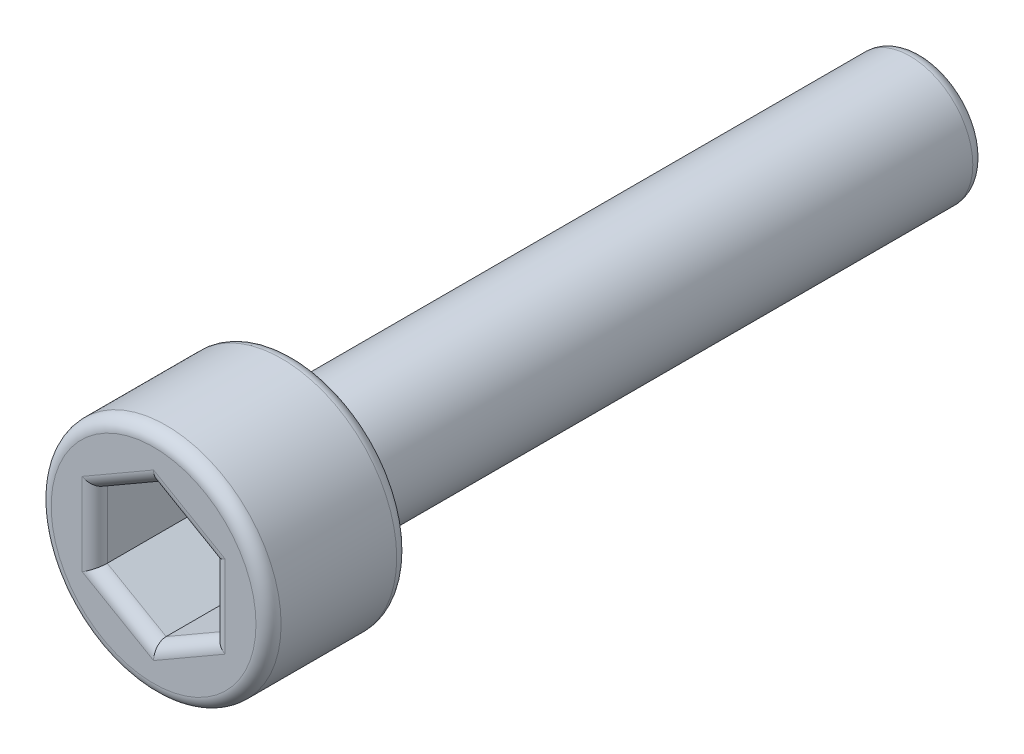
ISO-10303-21;
HEADER;
FILE_DESCRIPTION(('STEP AP214'),'2;1');
FILE_NAME('part.step','',(''),(''),'','','');
FILE_SCHEMA(('AUTOMOTIVE_DESIGN { 1 0 10303 214 1 1 1 1 }'));
ENDSEC;
DATA;
#1=APPLICATION_CONTEXT('core data for automotive mechanical design processes');
#2=APPLICATION_PROTOCOL_DEFINITION('international standard','automotive_design',2000,#1);
#3=PRODUCT_CONTEXT('',#1,'mechanical');
#4=PRODUCT('Part','Part','',(#3));
#5=PRODUCT_RELATED_PRODUCT_CATEGORY('part','',(#4));
#6=PRODUCT_DEFINITION_FORMATION('','',#4);
#7=PRODUCT_DEFINITION_CONTEXT('part definition',#1,'design');
#8=PRODUCT_DEFINITION('design','',#6,#7);
#9=PRODUCT_DEFINITION_SHAPE('','',#8);
#10=(LENGTH_UNIT() NAMED_UNIT(*) SI_UNIT(.MILLI.,.METRE.));
#11=(NAMED_UNIT(*) PLANE_ANGLE_UNIT() SI_UNIT($,.RADIAN.));
#12=(NAMED_UNIT(*) SI_UNIT($,.STERADIAN.) SOLID_ANGLE_UNIT());
#13=UNCERTAINTY_MEASURE_WITH_UNIT(LENGTH_MEASURE(1.E-05),#10,'distance_accuracy_value','');
#14=(GEOMETRIC_REPRESENTATION_CONTEXT(3) GLOBAL_UNCERTAINTY_ASSIGNED_CONTEXT((#13)) GLOBAL_UNIT_ASSIGNED_CONTEXT((#10,
#11,#12)) REPRESENTATION_CONTEXT('',''));
#15=CARTESIAN_POINT('',(0.,0.,0.));
#16=DIRECTION('',(0.,0.,1.));
#17=DIRECTION('',(1.,0.,0.));
#18=AXIS2_PLACEMENT_3D('',#15,#16,#17);
#19=CARTESIAN_POINT('',(0.,0.,12.7));
#20=DIRECTION('',(0.,0.,-1.));
#21=DIRECTION('',(-1.,0.,0.));
#22=AXIS2_PLACEMENT_3D('',#19,#20,#21);
#23=CYLINDRICAL_SURFACE('',#22,1.27);
#24=CARTESIAN_POINT('',(0.,0.,0.254000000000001));
#25=DIRECTION('',(0.,0.,1.));
#26=DIRECTION('',(1.,0.,0.));
#27=AXIS2_PLACEMENT_3D('',#24,#25,#26);
#28=CIRCLE('',#27,1.27);
#29=CARTESIAN_POINT('',(1.27,0.,0.254000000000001));
#30=VERTEX_POINT('',#29);
#31=EDGE_CURVE('E38',#30,#30,#28,.T.);
#32=ORIENTED_EDGE('',*,*,#31,.T.);
#33=EDGE_LOOP('',(#32));
#34=FACE_BOUND('',#33,.T.);
#35=CARTESIAN_POINT('',(0.,0.,12.7));
#36=DIRECTION('',(0.,0.,1.));
#37=DIRECTION('',(1.,0.,0.));
#38=AXIS2_PLACEMENT_3D('',#35,#36,#37);
#39=CIRCLE('',#38,1.27);
#40=CARTESIAN_POINT('',(1.27,0.,12.7));
#41=VERTEX_POINT('',#40);
#42=EDGE_CURVE('E144',#41,#41,#39,.T.);
#43=ORIENTED_EDGE('',*,*,#42,.F.);
#44=EDGE_LOOP('',(#43));
#45=FACE_BOUND('',#44,.T.);
#46=ADVANCED_FACE('F31',(#34,#45),#23,.T.);
#47=CARTESIAN_POINT('',(0.,0.,0.));
#48=DIRECTION('',(0.,0.,1.));
#49=DIRECTION('',(1.,0.,0.));
#50=AXIS2_PLACEMENT_3D('',#47,#48,#49);
#51=PLANE('',#50);
#52=CARTESIAN_POINT('',(0.,0.,0.));
#53=DIRECTION('',(0.,0.,1.));
#54=DIRECTION('',(1.,0.,0.));
#55=AXIS2_PLACEMENT_3D('',#52,#53,#54);
#56=CIRCLE('',#55,1.016);
#57=CARTESIAN_POINT('',(1.016,0.,0.));
#58=VERTEX_POINT('',#57);
#59=EDGE_CURVE('E11',#58,#58,#56,.F.);
#60=ORIENTED_EDGE('',*,*,#59,.T.);
#61=EDGE_LOOP('',(#60));
#62=FACE_BOUND('',#61,.T.);
#63=ADVANCED_FACE('F205',(#62),#51,.F.);
#64=CARTESIAN_POINT('',(0.,0.,12.7));
#65=DIRECTION('',(0.,0.,1.));
#66=DIRECTION('',(1.,0.,0.));
#67=AXIS2_PLACEMENT_3D('',#64,#65,#66);
#68=PLANE('',#67);
#69=CARTESIAN_POINT('',(0.,0.,12.7));
#70=DIRECTION('',(0.,0.,1.));
#71=DIRECTION('',(1.,0.,0.));
#72=AXIS2_PLACEMENT_3D('',#69,#70,#71);
#73=CIRCLE('',#72,2.0701);
#74=CARTESIAN_POINT('',(2.0701,0.,12.7));
#75=VERTEX_POINT('',#74);
#76=EDGE_CURVE('E182',#75,#75,#73,.F.);
#77=ORIENTED_EDGE('',*,*,#76,.T.);
#78=EDGE_LOOP('',(#77));
#79=FACE_BOUND('',#78,.T.);
#80=ORIENTED_EDGE('',*,*,#42,.T.);
#81=EDGE_LOOP('',(#80));
#82=FACE_BOUND('',#81,.T.);
#83=ADVANCED_FACE('F209',(#79,#82),#68,.F.);
#84=CARTESIAN_POINT('',(0.,0.,15.5448));
#85=DIRECTION('',(0.,0.,-1.));
#86=DIRECTION('',(-1.,0.,0.));
#87=AXIS2_PLACEMENT_3D('',#84,#85,#86);
#88=CYLINDRICAL_SURFACE('',#87,2.3241);
#89=CARTESIAN_POINT('',(0.,0.,12.954));
#90=DIRECTION('',(0.,0.,1.));
#91=DIRECTION('',(1.,0.,0.));
#92=AXIS2_PLACEMENT_3D('',#89,#90,#91);
#93=CIRCLE('',#92,2.3241);
#94=CARTESIAN_POINT('',(2.3241,0.,12.954));
#95=VERTEX_POINT('',#94);
#96=EDGE_CURVE('E179',#95,#95,#93,.T.);
#97=ORIENTED_EDGE('',*,*,#96,.T.);
#98=EDGE_LOOP('',(#97));
#99=FACE_BOUND('',#98,.T.);
#100=CARTESIAN_POINT('',(0.,0.,15.2908));
#101=DIRECTION('',(0.,0.,1.));
#102=DIRECTION('',(1.,0.,0.));
#103=AXIS2_PLACEMENT_3D('',#100,#101,#102);
#104=CIRCLE('',#103,2.3241);
#105=CARTESIAN_POINT('',(2.3241,0.,15.2908));
#106=VERTEX_POINT('',#105);
#107=EDGE_CURVE('E176',#106,#106,#104,.F.);
#108=ORIENTED_EDGE('',*,*,#107,.T.);
#109=EDGE_LOOP('',(#108));
#110=FACE_BOUND('',#109,.T.);
#111=ADVANCED_FACE('F214',(#99,#110),#88,.T.);
#112=CARTESIAN_POINT('',(0.,0.,15.5448));
#113=DIRECTION('',(0.,0.,1.));
#114=DIRECTION('',(1.,0.,0.));
#115=AXIS2_PLACEMENT_3D('',#112,#113,#114);
#116=PLANE('',#115);
#117=CARTESIAN_POINT('',(0.,0.,15.5448));
#118=DIRECTION('',(0.,0.,1.));
#119=DIRECTION('',(1.,0.,0.));
#120=AXIS2_PLACEMENT_3D('',#117,#118,#119);
#121=CIRCLE('',#120,2.0701);
#122=CARTESIAN_POINT('',(2.0701,0.,15.5448));
#123=VERTEX_POINT('',#122);
#124=EDGE_CURVE('E185',#123,#123,#121,.T.);
#125=ORIENTED_EDGE('',*,*,#124,.T.);
#126=EDGE_LOOP('',(#125));
#127=FACE_BOUND('',#126,.T.);
#128=DIRECTION('',(0.866025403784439,0.5,0.));
#129=VECTOR('',#128,1.);
#130=CARTESIAN_POINT('',(0.127,-1.59478578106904,15.5448));
#131=LINE('',#130,#129);
#132=CARTESIAN_POINT('',(1.444625,-0.834054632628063,15.5448));
#133=VERTEX_POINT('',#132);
#134=CARTESIAN_POINT('',(0.,-1.66810926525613,15.5448));
#135=VERTEX_POINT('',#134);
#136=EDGE_CURVE('E163',#133,#135,#131,.F.);
#137=ORIENTED_EDGE('',*,*,#136,.T.);
#138=DIRECTION('',(0.866025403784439,-0.5,0.));
#139=VECTOR('',#138,1.);
#140=CARTESIAN_POINT('',(-1.317625,-0.907378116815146,15.5448));
#141=LINE('',#140,#139);
#142=CARTESIAN_POINT('',(-1.444625,-0.834054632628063,15.5448));
#143=VERTEX_POINT('',#142);
#144=EDGE_CURVE('E165',#135,#143,#141,.F.);
#145=ORIENTED_EDGE('',*,*,#144,.T.);
#146=DIRECTION('',(0.,-1.,0.));
#147=VECTOR('',#146,1.);
#148=CARTESIAN_POINT('',(-1.444625,0.687407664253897,15.5448));
#149=LINE('',#148,#147);
#150=CARTESIAN_POINT('',(-1.444625,0.834054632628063,15.5448));
#151=VERTEX_POINT('',#150);
#152=EDGE_CURVE('E155',#143,#151,#149,.F.);
#153=ORIENTED_EDGE('',*,*,#152,.T.);
#154=DIRECTION('',(-0.866025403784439,-0.5,0.));
#155=VECTOR('',#154,1.);
#156=CARTESIAN_POINT('',(-0.127,1.59478578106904,15.5448));
#157=LINE('',#156,#155);
#158=CARTESIAN_POINT('',(0.,1.66810926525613,15.5448));
#159=VERTEX_POINT('',#158);
#160=EDGE_CURVE('E157',#151,#159,#157,.F.);
#161=ORIENTED_EDGE('',*,*,#160,.T.);
#162=DIRECTION('',(-0.866025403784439,0.5,0.));
#163=VECTOR('',#162,1.);
#164=CARTESIAN_POINT('',(1.317625,0.907378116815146,15.5448));
#165=LINE('',#164,#163);
#166=CARTESIAN_POINT('',(1.444625,0.834054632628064,15.5448));
#167=VERTEX_POINT('',#166);
#168=EDGE_CURVE('E159',#159,#167,#165,.F.);
#169=ORIENTED_EDGE('',*,*,#168,.T.);
#170=DIRECTION('',(0.,1.,0.));
#171=VECTOR('',#170,1.);
#172=CARTESIAN_POINT('',(1.444625,-0.687407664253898,15.5448));
#173=LINE('',#172,#171);
#174=EDGE_CURVE('E161',#167,#133,#173,.F.);
#175=ORIENTED_EDGE('',*,*,#174,.T.);
#176=EDGE_LOOP('',(#137,#145,#153,#161,#169,#175));
#177=FACE_BOUND('',#176,.T.);
#178=ADVANCED_FACE('F220',(#127,#177),#116,.T.);
#179=CARTESIAN_POINT('',(-1.190625,-0.687407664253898,13.5128));
#180=DIRECTION('',(-0.5,-0.866025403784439,0.));
#181=DIRECTION('',(0.866025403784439,-0.5,0.));
#182=AXIS2_PLACEMENT_3D('',#179,#180,#181);
#183=PLANE('',#182);
#184=DIRECTION('',(0.,0.,1.));
#185=VECTOR('',#184,1.);
#186=CARTESIAN_POINT('',(-1.190625,-0.687407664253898,13.5128));
#187=LINE('',#186,#185);
#188=CARTESIAN_POINT('',(-1.190625,-0.687407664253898,13.5128));
#189=VERTEX_POINT('',#188);
#190=CARTESIAN_POINT('',(-1.190625,-0.687407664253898,15.2908));
#191=VERTEX_POINT('',#190);
#192=EDGE_CURVE('E142',#189,#191,#187,.T.);
#193=ORIENTED_EDGE('',*,*,#192,.T.);
#194=DIRECTION('',(0.866025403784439,-0.5,0.));
#195=VECTOR('',#194,1.);
#196=CARTESIAN_POINT('',(0.,-1.3748153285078,15.2908));
#197=LINE('',#196,#195);
#198=CARTESIAN_POINT('',(0.,-1.3748153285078,15.2908));
#199=VERTEX_POINT('',#198);
#200=EDGE_CURVE('E111',#191,#199,#197,.T.);
#201=ORIENTED_EDGE('',*,*,#200,.T.);
#202=DIRECTION('',(0.,0.,1.));
#203=VECTOR('',#202,1.);
#204=CARTESIAN_POINT('',(0.,-1.3748153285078,13.5128));
#205=LINE('',#204,#203);
#206=CARTESIAN_POINT('',(0.,-1.3748153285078,13.5128));
#207=VERTEX_POINT('',#206);
#208=EDGE_CURVE('E103',#207,#199,#205,.T.);
#209=ORIENTED_EDGE('',*,*,#208,.F.);
#210=DIRECTION('',(0.866025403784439,-0.5,0.));
#211=VECTOR('',#210,1.);
#212=CARTESIAN_POINT('',(-1.190625,-0.687407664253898,13.5128));
#213=LINE('',#212,#211);
#214=EDGE_CURVE('E108',#189,#207,#213,.T.);
#215=ORIENTED_EDGE('',*,*,#214,.F.);
#216=EDGE_LOOP('',(#193,#201,#209,#215));
#217=FACE_BOUND('',#216,.T.);
#218=ADVANCED_FACE('F106',(#217),#183,.F.);
#219=CARTESIAN_POINT('',(-1.190625,0.687407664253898,13.5128));
#220=DIRECTION('',(-1.,0.,0.));
#221=DIRECTION('',(0.,-1.,0.));
#222=AXIS2_PLACEMENT_3D('',#219,#220,#221);
#223=PLANE('',#222);
#224=DIRECTION('',(0.,0.,1.));
#225=VECTOR('',#224,1.);
#226=CARTESIAN_POINT('',(-1.190625,0.687407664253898,13.5128));
#227=LINE('',#226,#225);
#228=CARTESIAN_POINT('',(-1.190625,0.687407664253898,13.5128));
#229=VERTEX_POINT('',#228);
#230=CARTESIAN_POINT('',(-1.190625,0.687407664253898,15.2908));
#231=VERTEX_POINT('',#230);
#232=EDGE_CURVE('E145',#229,#231,#227,.T.);
#233=ORIENTED_EDGE('',*,*,#232,.T.);
#234=DIRECTION('',(0.,-1.,0.));
#235=VECTOR('',#234,1.);
#236=CARTESIAN_POINT('',(-1.190625,-0.687407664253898,15.2908));
#237=LINE('',#236,#235);
#238=EDGE_CURVE('E174',#231,#191,#237,.T.);
#239=ORIENTED_EDGE('',*,*,#238,.T.);
#240=ORIENTED_EDGE('',*,*,#192,.F.);
#241=DIRECTION('',(0.,-1.,0.));
#242=VECTOR('',#241,1.);
#243=CARTESIAN_POINT('',(-1.190625,0.687407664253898,13.5128));
#244=LINE('',#243,#242);
#245=EDGE_CURVE('E114',#229,#189,#244,.T.);
#246=ORIENTED_EDGE('',*,*,#245,.F.);
#247=EDGE_LOOP('',(#233,#239,#240,#246));
#248=FACE_BOUND('',#247,.T.);
#249=ADVANCED_FACE('F227',(#248),#223,.F.);
#250=CARTESIAN_POINT('',(0.,1.3748153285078,13.5128));
#251=DIRECTION('',(-0.5,0.866025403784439,0.));
#252=DIRECTION('',(-0.866025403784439,-0.5,0.));
#253=AXIS2_PLACEMENT_3D('',#250,#251,#252);
#254=PLANE('',#253);
#255=DIRECTION('',(0.,0.,1.));
#256=VECTOR('',#255,1.);
#257=CARTESIAN_POINT('',(0.,1.3748153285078,13.5128));
#258=LINE('',#257,#256);
#259=CARTESIAN_POINT('',(0.,1.3748153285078,13.5128));
#260=VERTEX_POINT('',#259);
#261=CARTESIAN_POINT('',(0.,1.3748153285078,15.2908));
#262=VERTEX_POINT('',#261);
#263=EDGE_CURVE('E147',#260,#262,#258,.T.);
#264=ORIENTED_EDGE('',*,*,#263,.T.);
#265=DIRECTION('',(-0.866025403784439,-0.5,0.));
#266=VECTOR('',#265,1.);
#267=CARTESIAN_POINT('',(-1.190625,0.687407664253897,15.2908));
#268=LINE('',#267,#266);
#269=EDGE_CURVE('E45',#262,#231,#268,.T.);
#270=ORIENTED_EDGE('',*,*,#269,.T.);
#271=ORIENTED_EDGE('',*,*,#232,.F.);
#272=DIRECTION('',(-0.866025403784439,-0.5,0.));
#273=VECTOR('',#272,1.);
#274=CARTESIAN_POINT('',(0.,1.3748153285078,13.5128));
#275=LINE('',#274,#273);
#276=EDGE_CURVE('E139',#260,#229,#275,.T.);
#277=ORIENTED_EDGE('',*,*,#276,.F.);
#278=EDGE_LOOP('',(#264,#270,#271,#277));
#279=FACE_BOUND('',#278,.T.);
#280=ADVANCED_FACE('F237',(#279),#254,.F.);
#281=CARTESIAN_POINT('',(1.190625,0.687407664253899,13.5128));
#282=DIRECTION('',(0.5,0.866025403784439,0.));
#283=DIRECTION('',(-0.866025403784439,0.5,0.));
#284=AXIS2_PLACEMENT_3D('',#281,#282,#283);
#285=PLANE('',#284);
#286=DIRECTION('',(0.,0.,1.));
#287=VECTOR('',#286,1.);
#288=CARTESIAN_POINT('',(1.190625,0.687407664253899,13.5128));
#289=LINE('',#288,#287);
#290=CARTESIAN_POINT('',(1.190625,0.687407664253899,13.5128));
#291=VERTEX_POINT('',#290);
#292=CARTESIAN_POINT('',(1.190625,0.687407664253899,15.2908));
#293=VERTEX_POINT('',#292);
#294=EDGE_CURVE('E149',#291,#293,#289,.T.);
#295=ORIENTED_EDGE('',*,*,#294,.T.);
#296=DIRECTION('',(-0.866025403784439,0.5,0.));
#297=VECTOR('',#296,1.);
#298=CARTESIAN_POINT('',(0.,1.3748153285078,15.2908));
#299=LINE('',#298,#297);
#300=EDGE_CURVE('E53',#293,#262,#299,.T.);
#301=ORIENTED_EDGE('',*,*,#300,.T.);
#302=ORIENTED_EDGE('',*,*,#263,.F.);
#303=DIRECTION('',(-0.866025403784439,0.5,0.));
#304=VECTOR('',#303,1.);
#305=CARTESIAN_POINT('',(1.190625,0.687407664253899,13.5128));
#306=LINE('',#305,#304);
#307=EDGE_CURVE('E136',#291,#260,#306,.T.);
#308=ORIENTED_EDGE('',*,*,#307,.F.);
#309=EDGE_LOOP('',(#295,#301,#302,#308));
#310=FACE_BOUND('',#309,.T.);
#311=ADVANCED_FACE('F233',(#310),#285,.F.);
#312=CARTESIAN_POINT('',(1.190625,-0.687407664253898,13.5128));
#313=DIRECTION('',(1.,0.,0.));
#314=DIRECTION('',(0.,1.,0.));
#315=AXIS2_PLACEMENT_3D('',#312,#313,#314);
#316=PLANE('',#315);
#317=DIRECTION('',(0.,0.,1.));
#318=VECTOR('',#317,1.);
#319=CARTESIAN_POINT('',(1.190625,-0.687407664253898,13.5128));
#320=LINE('',#319,#318);
#321=CARTESIAN_POINT('',(1.190625,-0.687407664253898,13.5128));
#322=VERTEX_POINT('',#321);
#323=CARTESIAN_POINT('',(1.190625,-0.687407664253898,15.2908));
#324=VERTEX_POINT('',#323);
#325=EDGE_CURVE('E113',#322,#324,#320,.T.);
#326=ORIENTED_EDGE('',*,*,#325,.T.);
#327=DIRECTION('',(0.,1.,0.));
#328=VECTOR('',#327,1.);
#329=CARTESIAN_POINT('',(1.190625,0.687407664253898,15.2908));
#330=LINE('',#329,#328);
#331=EDGE_CURVE('E170',#324,#293,#330,.T.);
#332=ORIENTED_EDGE('',*,*,#331,.T.);
#333=ORIENTED_EDGE('',*,*,#294,.F.);
#334=DIRECTION('',(0.,1.,0.));
#335=VECTOR('',#334,1.);
#336=CARTESIAN_POINT('',(1.190625,-0.687407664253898,13.5128));
#337=LINE('',#336,#335);
#338=EDGE_CURVE('E123',#322,#291,#337,.T.);
#339=ORIENTED_EDGE('',*,*,#338,.F.);
#340=EDGE_LOOP('',(#326,#332,#333,#339));
#341=FACE_BOUND('',#340,.T.);
#342=ADVANCED_FACE('F230',(#341),#316,.F.);
#343=CARTESIAN_POINT('',(0.,-1.3748153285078,13.5128));
#344=DIRECTION('',(0.5,-0.866025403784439,0.));
#345=DIRECTION('',(0.866025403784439,0.5,0.));
#346=AXIS2_PLACEMENT_3D('',#343,#344,#345);
#347=PLANE('',#346);
#348=ORIENTED_EDGE('',*,*,#208,.T.);
#349=DIRECTION('',(0.866025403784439,0.5,0.));
#350=VECTOR('',#349,1.);
#351=CARTESIAN_POINT('',(1.190625,-0.687407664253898,15.2908));
#352=LINE('',#351,#350);
#353=EDGE_CURVE('E168',#199,#324,#352,.T.);
#354=ORIENTED_EDGE('',*,*,#353,.T.);
#355=ORIENTED_EDGE('',*,*,#325,.F.);
#356=DIRECTION('',(0.866025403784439,0.5,0.));
#357=VECTOR('',#356,1.);
#358=CARTESIAN_POINT('',(0.,-1.3748153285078,13.5128));
#359=LINE('',#358,#357);
#360=EDGE_CURVE('E117',#207,#322,#359,.T.);
#361=ORIENTED_EDGE('',*,*,#360,.F.);
#362=EDGE_LOOP('',(#348,#354,#355,#361));
#363=FACE_BOUND('',#362,.T.);
#364=ADVANCED_FACE('F118',(#363),#347,.F.);
#365=CARTESIAN_POINT('',(1.190625,-2.06222299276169,13.5128));
#366=DIRECTION('',(0.,0.,1.));
#367=DIRECTION('',(1.,0.,0.));
#368=AXIS2_PLACEMENT_3D('',#365,#366,#367);
#369=PLANE('',#368);
#370=ORIENTED_EDGE('',*,*,#214,.T.);
#371=ORIENTED_EDGE('',*,*,#360,.T.);
#372=ORIENTED_EDGE('',*,*,#338,.T.);
#373=ORIENTED_EDGE('',*,*,#307,.T.);
#374=ORIENTED_EDGE('',*,*,#276,.T.);
#375=ORIENTED_EDGE('',*,*,#245,.T.);
#376=EDGE_LOOP('',(#370,#371,#372,#373,#374,#375));
#377=FACE_BOUND('',#376,.T.);
#378=ADVANCED_FACE('F125',(#377),#369,.T.);
#379=CARTESIAN_POINT('',(1.317625,0.907378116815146,15.2908));
#380=DIRECTION('',(0.866025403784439,-0.5,0.));
#381=DIRECTION('',(0.5,0.866025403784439,0.));
#382=AXIS2_PLACEMENT_3D('',#379,#380,#381);
#383=CYLINDRICAL_SURFACE('',#382,0.254);
#384=CARTESIAN_POINT('',(1.444625,0.834054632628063,15.2908));
#385=DIRECTION('',(0.5,-0.866025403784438,0.));
#386=DIRECTION('',(-0.866025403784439,-0.5,0.));
#387=AXIS2_PLACEMENT_3D('',#384,#385,#386);
#388=ELLIPSE('',#387,0.29329393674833,0.254);
#389=EDGE_CURVE('E131',#167,#293,#388,.T.);
#390=ORIENTED_EDGE('',*,*,#389,.F.);
#391=ORIENTED_EDGE('',*,*,#168,.F.);
#392=CARTESIAN_POINT('',(0.,1.66810926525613,15.2908));
#393=DIRECTION('',(1.,0.,0.));
#394=DIRECTION('',(0.,-1.,0.));
#395=AXIS2_PLACEMENT_3D('',#392,#393,#394);
#396=ELLIPSE('',#395,0.29329393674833,0.254);
#397=EDGE_CURVE('E128',#262,#159,#396,.F.);
#398=ORIENTED_EDGE('',*,*,#397,.F.);
#399=ORIENTED_EDGE('',*,*,#300,.F.);
#400=EDGE_LOOP('',(#390,#391,#398,#399));
#401=FACE_BOUND('',#400,.T.);
#402=ADVANCED_FACE('F245',(#401),#383,.T.);
#403=CARTESIAN_POINT('',(-0.127,1.59478578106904,15.2908));
#404=DIRECTION('',(0.866025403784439,0.5,0.));
#405=DIRECTION('',(-0.5,0.866025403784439,0.));
#406=AXIS2_PLACEMENT_3D('',#403,#404,#405);
#407=CYLINDRICAL_SURFACE('',#406,0.254);
#408=ORIENTED_EDGE('',*,*,#397,.T.);
#409=ORIENTED_EDGE('',*,*,#160,.F.);
#410=CARTESIAN_POINT('',(-1.444625,0.834054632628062,15.2908));
#411=DIRECTION('',(0.5,0.866025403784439,0.));
#412=DIRECTION('',(0.866025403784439,-0.5,0.));
#413=AXIS2_PLACEMENT_3D('',#410,#411,#412);
#414=ELLIPSE('',#413,0.29329393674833,0.254);
#415=EDGE_CURVE('E297',#231,#151,#414,.F.);
#416=ORIENTED_EDGE('',*,*,#415,.F.);
#417=ORIENTED_EDGE('',*,*,#269,.F.);
#418=EDGE_LOOP('',(#408,#409,#416,#417));
#419=FACE_BOUND('',#418,.T.);
#420=ADVANCED_FACE('F248',(#419),#407,.T.);
#421=CARTESIAN_POINT('',(1.444625,-0.687407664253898,15.2908));
#422=DIRECTION('',(0.,-1.,0.));
#423=DIRECTION('',(1.,0.,0.));
#424=AXIS2_PLACEMENT_3D('',#421,#422,#423);
#425=CYLINDRICAL_SURFACE('',#424,0.254);
#426=ORIENTED_EDGE('',*,*,#389,.T.);
#427=ORIENTED_EDGE('',*,*,#331,.F.);
#428=CARTESIAN_POINT('',(1.444625,-0.834054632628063,15.2908));
#429=DIRECTION('',(-0.5,-0.866025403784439,0.));
#430=DIRECTION('',(-0.866025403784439,0.5,0.));
#431=AXIS2_PLACEMENT_3D('',#428,#429,#430);
#432=ELLIPSE('',#431,0.29329393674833,0.254);
#433=EDGE_CURVE('E293',#133,#324,#432,.T.);
#434=ORIENTED_EDGE('',*,*,#433,.F.);
#435=ORIENTED_EDGE('',*,*,#174,.F.);
#436=EDGE_LOOP('',(#426,#427,#434,#435));
#437=FACE_BOUND('',#436,.T.);
#438=ADVANCED_FACE('F252',(#437),#425,.T.);
#439=CARTESIAN_POINT('',(-1.444625,0.687407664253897,15.2908));
#440=DIRECTION('',(0.,1.,0.));
#441=DIRECTION('',(-1.,0.,0.));
#442=AXIS2_PLACEMENT_3D('',#439,#440,#441);
#443=CYLINDRICAL_SURFACE('',#442,0.254);
#444=ORIENTED_EDGE('',*,*,#415,.T.);
#445=ORIENTED_EDGE('',*,*,#152,.F.);
#446=CARTESIAN_POINT('',(-1.444625,-0.834054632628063,15.2908));
#447=DIRECTION('',(-0.5,0.866025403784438,0.));
#448=DIRECTION('',(-0.866025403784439,-0.5,0.));
#449=AXIS2_PLACEMENT_3D('',#446,#447,#448);
#450=ELLIPSE('',#449,0.29329393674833,0.254);
#451=EDGE_CURVE('E290',#191,#143,#450,.F.);
#452=ORIENTED_EDGE('',*,*,#451,.F.);
#453=ORIENTED_EDGE('',*,*,#238,.F.);
#454=EDGE_LOOP('',(#444,#445,#452,#453));
#455=FACE_BOUND('',#454,.T.);
#456=ADVANCED_FACE('F256',(#455),#443,.T.);
#457=CARTESIAN_POINT('',(0.127,-1.59478578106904,15.2908));
#458=DIRECTION('',(-0.866025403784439,-0.5,0.));
#459=DIRECTION('',(0.5,-0.866025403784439,0.));
#460=AXIS2_PLACEMENT_3D('',#457,#458,#459);
#461=CYLINDRICAL_SURFACE('',#460,0.254);
#462=ORIENTED_EDGE('',*,*,#433,.T.);
#463=ORIENTED_EDGE('',*,*,#353,.F.);
#464=CARTESIAN_POINT('',(0.,-1.66810926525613,15.2908));
#465=DIRECTION('',(-1.,0.,0.));
#466=DIRECTION('',(0.,1.,0.));
#467=AXIS2_PLACEMENT_3D('',#464,#465,#466);
#468=ELLIPSE('',#467,0.29329393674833,0.254);
#469=EDGE_CURVE('E287',#135,#199,#468,.T.);
#470=ORIENTED_EDGE('',*,*,#469,.F.);
#471=ORIENTED_EDGE('',*,*,#136,.F.);
#472=EDGE_LOOP('',(#462,#463,#470,#471));
#473=FACE_BOUND('',#472,.T.);
#474=ADVANCED_FACE('F260',(#473),#461,.T.);
#475=CARTESIAN_POINT('',(-1.317625,-0.907378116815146,15.2908));
#476=DIRECTION('',(-0.866025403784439,0.5,0.));
#477=DIRECTION('',(-0.5,-0.866025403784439,0.));
#478=AXIS2_PLACEMENT_3D('',#475,#476,#477);
#479=CYLINDRICAL_SURFACE('',#478,0.254);
#480=ORIENTED_EDGE('',*,*,#451,.T.);
#481=ORIENTED_EDGE('',*,*,#144,.F.);
#482=ORIENTED_EDGE('',*,*,#469,.T.);
#483=ORIENTED_EDGE('',*,*,#200,.F.);
#484=EDGE_LOOP('',(#480,#481,#482,#483));
#485=FACE_BOUND('',#484,.T.);
#486=ADVANCED_FACE('F264',(#485),#479,.T.);
#487=CARTESIAN_POINT('',(0.,0.,12.954));
#488=DIRECTION('',(0.,0.,1.));
#489=DIRECTION('',(1.,0.,0.));
#490=AXIS2_PLACEMENT_3D('',#487,#488,#489);
#491=TOROIDAL_SURFACE('',#490,2.0701,0.254);
#492=ORIENTED_EDGE('',*,*,#76,.F.);
#493=EDGE_LOOP('',(#492));
#494=FACE_BOUND('',#493,.T.);
#495=ORIENTED_EDGE('',*,*,#96,.F.);
#496=EDGE_LOOP('',(#495));
#497=FACE_BOUND('',#496,.T.);
#498=ADVANCED_FACE('F200',(#494,#497),#491,.T.);
#499=CARTESIAN_POINT('',(0.,0.,15.2908));
#500=DIRECTION('',(0.,0.,1.));
#501=DIRECTION('',(1.,0.,0.));
#502=AXIS2_PLACEMENT_3D('',#499,#500,#501);
#503=TOROIDAL_SURFACE('',#502,2.0701,0.254);
#504=ORIENTED_EDGE('',*,*,#107,.F.);
#505=EDGE_LOOP('',(#504));
#506=FACE_BOUND('',#505,.T.);
#507=ORIENTED_EDGE('',*,*,#124,.F.);
#508=EDGE_LOOP('',(#507));
#509=FACE_BOUND('',#508,.T.);
#510=ADVANCED_FACE('F194',(#506,#509),#503,.T.);
#511=CARTESIAN_POINT('',(0.,0.,0.254000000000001));
#512=DIRECTION('',(0.,0.,1.));
#513=DIRECTION('',(1.,0.,0.));
#514=AXIS2_PLACEMENT_3D('',#511,#512,#513);
#515=TOROIDAL_SURFACE('',#514,1.016,0.254);
#516=ORIENTED_EDGE('',*,*,#59,.F.);
#517=EDGE_LOOP('',(#516));
#518=FACE_BOUND('',#517,.T.);
#519=ORIENTED_EDGE('',*,*,#31,.F.);
#520=EDGE_LOOP('',(#519));
#521=FACE_BOUND('',#520,.T.);
#522=ADVANCED_FACE('F192',(#518,#521),#515,.T.);
#523=CLOSED_SHELL('',(#46,#63,#83,#111,#178,#218,#249,#280,#311,#342,#364,#378,#402,#420,#438,
#456,#474,#486,#498,#510,#522));
#524=MANIFOLD_SOLID_BREP('B2',#523);
#525=ADVANCED_BREP_SHAPE_REPRESENTATION('',(#18,#524),#14);
#526=SHAPE_DEFINITION_REPRESENTATION(#9,#525);
ENDSEC;
END-ISO-10303-21;
